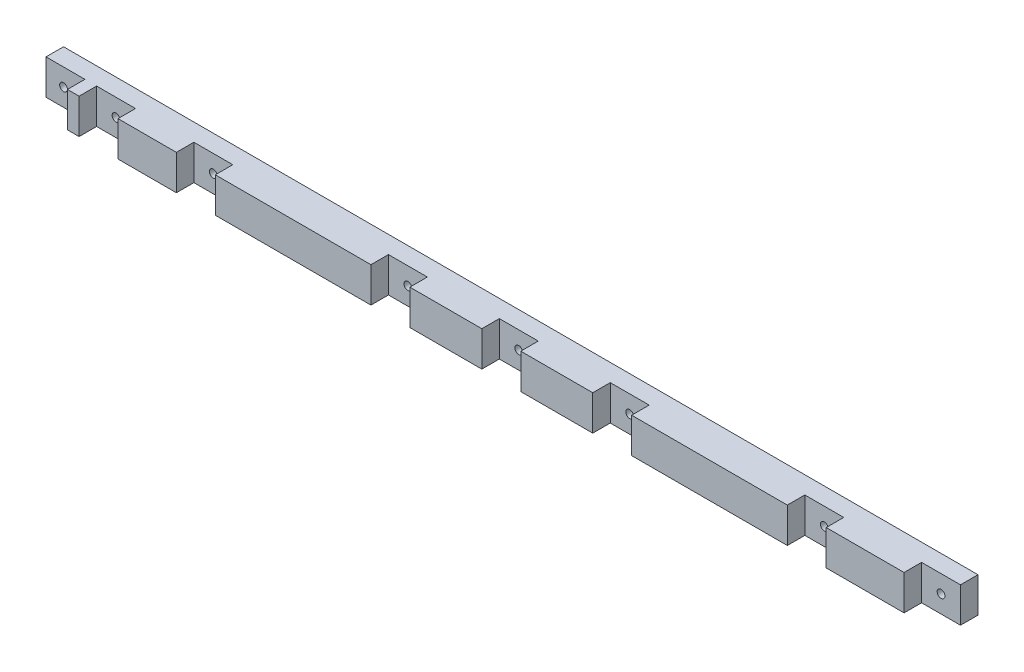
ISO-10303-21;
HEADER;
FILE_DESCRIPTION(('STEP AP214'),'2;1');
FILE_NAME('part.step','',(''),(''),'','','');
FILE_SCHEMA(('AUTOMOTIVE_DESIGN { 1 0 10303 214 1 1 1 1 }'));
ENDSEC;
DATA;
#1=APPLICATION_CONTEXT('core data for automotive mechanical design processes');
#2=APPLICATION_PROTOCOL_DEFINITION('international standard','automotive_design',2000,#1);
#3=PRODUCT_CONTEXT('',#1,'mechanical');
#4=PRODUCT('Part','Part','',(#3));
#5=PRODUCT_RELATED_PRODUCT_CATEGORY('part','',(#4));
#6=PRODUCT_DEFINITION_FORMATION('','',#4);
#7=PRODUCT_DEFINITION_CONTEXT('part definition',#1,'design');
#8=PRODUCT_DEFINITION('design','',#6,#7);
#9=PRODUCT_DEFINITION_SHAPE('','',#8);
#10=(LENGTH_UNIT() NAMED_UNIT(*) SI_UNIT(.MILLI.,.METRE.));
#11=(NAMED_UNIT(*) PLANE_ANGLE_UNIT() SI_UNIT($,.RADIAN.));
#12=(NAMED_UNIT(*) SI_UNIT($,.STERADIAN.) SOLID_ANGLE_UNIT());
#13=UNCERTAINTY_MEASURE_WITH_UNIT(LENGTH_MEASURE(1.E-05),#10,'distance_accuracy_value','');
#14=(GEOMETRIC_REPRESENTATION_CONTEXT(3) GLOBAL_UNCERTAINTY_ASSIGNED_CONTEXT((#13)) GLOBAL_UNIT_ASSIGNED_CONTEXT((#10,
#11,#12)) REPRESENTATION_CONTEXT('',''));
#15=CARTESIAN_POINT('',(0.,0.,0.));
#16=DIRECTION('',(0.,0.,1.));
#17=DIRECTION('',(1.,0.,0.));
#18=AXIS2_PLACEMENT_3D('',#15,#16,#17);
#19=CARTESIAN_POINT('',(0.,9.,9.));
#20=DIRECTION('',(0.,0.,-1.));
#21=DIRECTION('',(-1.,0.,0.));
#22=AXIS2_PLACEMENT_3D('',#19,#20,#21);
#23=PLANE('',#22);
#24=DIRECTION('',(1.,0.,0.));
#25=VECTOR('',#24,1.);
#26=CARTESIAN_POINT('',(0.,0.,9.));
#27=LINE('',#26,#25);
#28=CARTESIAN_POINT('',(155.,0.,9.));
#29=VERTEX_POINT('',#28);
#30=CARTESIAN_POINT('',(195.,0.,9.));
#31=VERTEX_POINT('',#30);
#32=EDGE_CURVE('E618',#29,#31,#27,.T.);
#33=ORIENTED_EDGE('',*,*,#32,.T.);
#34=DIRECTION('',(0.,-1.,0.));
#35=VECTOR('',#34,1.);
#36=CARTESIAN_POINT('',(195.,0.,9.));
#37=LINE('',#36,#35);
#38=CARTESIAN_POINT('',(195.,9.,9.));
#39=VERTEX_POINT('',#38);
#40=EDGE_CURVE('E488',#39,#31,#37,.T.);
#41=ORIENTED_EDGE('',*,*,#40,.F.);
#42=DIRECTION('',(-1.,0.,0.));
#43=VECTOR('',#42,1.);
#44=CARTESIAN_POINT('',(0.,9.,9.));
#45=LINE('',#44,#43);
#46=CARTESIAN_POINT('',(155.,9.,9.));
#47=VERTEX_POINT('',#46);
#48=EDGE_CURVE('E281',#39,#47,#45,.T.);
#49=ORIENTED_EDGE('',*,*,#48,.T.);
#50=DIRECTION('',(0.,1.,0.));
#51=VECTOR('',#50,1.);
#52=CARTESIAN_POINT('',(155.,0.,9.));
#53=LINE('',#52,#51);
#54=EDGE_CURVE('E453',#29,#47,#53,.T.);
#55=ORIENTED_EDGE('',*,*,#54,.F.);
#56=EDGE_LOOP('',(#33,#41,#49,#55));
#57=FACE_BOUND('',#56,.T.);
#58=ADVANCED_FACE('F31',(#57),#23,.F.);
#59=CARTESIAN_POINT('',(126.5,0.,9.));
#60=VERTEX_POINT('',#59);
#61=CARTESIAN_POINT('',(145.,0.,9.));
#62=VERTEX_POINT('',#61);
#63=EDGE_CURVE('E620',#60,#62,#27,.T.);
#64=ORIENTED_EDGE('',*,*,#63,.T.);
#65=DIRECTION('',(0.,-1.,0.));
#66=VECTOR('',#65,1.);
#67=CARTESIAN_POINT('',(145.,0.,9.));
#68=LINE('',#67,#66);
#69=CARTESIAN_POINT('',(145.,9.,9.));
#70=VERTEX_POINT('',#69);
#71=EDGE_CURVE('E457',#70,#62,#68,.T.);
#72=ORIENTED_EDGE('',*,*,#71,.F.);
#73=CARTESIAN_POINT('',(126.5,9.,9.));
#74=VERTEX_POINT('',#73);
#75=EDGE_CURVE('E597',#70,#74,#45,.T.);
#76=ORIENTED_EDGE('',*,*,#75,.T.);
#77=DIRECTION('',(0.,1.,0.));
#78=VECTOR('',#77,1.);
#79=CARTESIAN_POINT('',(126.5,0.,9.));
#80=LINE('',#79,#78);
#81=EDGE_CURVE('E420',#60,#74,#80,.T.);
#82=ORIENTED_EDGE('',*,*,#81,.F.);
#83=EDGE_LOOP('',(#64,#72,#76,#82));
#84=FACE_BOUND('',#83,.T.);
#85=ADVANCED_FACE('F538',(#84),#23,.F.);
#86=CARTESIAN_POINT('',(98.,0.,9.));
#87=VERTEX_POINT('',#86);
#88=CARTESIAN_POINT('',(116.5,0.,9.));
#89=VERTEX_POINT('',#88);
#90=EDGE_CURVE('E622',#87,#89,#27,.T.);
#91=ORIENTED_EDGE('',*,*,#90,.T.);
#92=DIRECTION('',(0.,-1.,0.));
#93=VECTOR('',#92,1.);
#94=CARTESIAN_POINT('',(116.5,0.,9.));
#95=LINE('',#94,#93);
#96=CARTESIAN_POINT('',(116.5,9.,9.));
#97=VERTEX_POINT('',#96);
#98=EDGE_CURVE('E424',#97,#89,#95,.T.);
#99=ORIENTED_EDGE('',*,*,#98,.F.);
#100=CARTESIAN_POINT('',(98.,9.,9.));
#101=VERTEX_POINT('',#100);
#102=EDGE_CURVE('E592',#97,#101,#45,.T.);
#103=ORIENTED_EDGE('',*,*,#102,.T.);
#104=DIRECTION('',(0.,1.,0.));
#105=VECTOR('',#104,1.);
#106=CARTESIAN_POINT('',(98.,0.,9.));
#107=LINE('',#106,#105);
#108=EDGE_CURVE('E387',#87,#101,#107,.T.);
#109=ORIENTED_EDGE('',*,*,#108,.F.);
#110=EDGE_LOOP('',(#91,#99,#103,#109));
#111=FACE_BOUND('',#110,.T.);
#112=ADVANCED_FACE('F545',(#111),#23,.F.);
#113=CARTESIAN_POINT('',(48.,0.,9.));
#114=VERTEX_POINT('',#113);
#115=CARTESIAN_POINT('',(88.,0.,9.));
#116=VERTEX_POINT('',#115);
#117=EDGE_CURVE('E765',#114,#116,#27,.T.);
#118=ORIENTED_EDGE('',*,*,#117,.T.);
#119=DIRECTION('',(0.,-1.,0.));
#120=VECTOR('',#119,1.);
#121=CARTESIAN_POINT('',(88.,0.,9.));
#122=LINE('',#121,#120);
#123=CARTESIAN_POINT('',(88.,9.,9.));
#124=VERTEX_POINT('',#123);
#125=EDGE_CURVE('E391',#124,#116,#122,.T.);
#126=ORIENTED_EDGE('',*,*,#125,.F.);
#127=CARTESIAN_POINT('',(48.,9.,9.));
#128=VERTEX_POINT('',#127);
#129=EDGE_CURVE('E588',#124,#128,#45,.T.);
#130=ORIENTED_EDGE('',*,*,#129,.T.);
#131=DIRECTION('',(0.,1.,0.));
#132=VECTOR('',#131,1.);
#133=CARTESIAN_POINT('',(48.,0.,9.));
#134=LINE('',#133,#132);
#135=EDGE_CURVE('E354',#114,#128,#134,.T.);
#136=ORIENTED_EDGE('',*,*,#135,.F.);
#137=EDGE_LOOP('',(#118,#126,#130,#136));
#138=FACE_BOUND('',#137,.T.);
#139=ADVANCED_FACE('F569',(#138),#23,.F.);
#140=CARTESIAN_POINT('',(23.,0.,9.));
#141=VERTEX_POINT('',#140);
#142=CARTESIAN_POINT('',(38.,0.,9.));
#143=VERTEX_POINT('',#142);
#144=EDGE_CURVE('E286',#141,#143,#27,.T.);
#145=ORIENTED_EDGE('',*,*,#144,.T.);
#146=DIRECTION('',(0.,-1.,0.));
#147=VECTOR('',#146,1.);
#148=CARTESIAN_POINT('',(38.,0.,9.));
#149=LINE('',#148,#147);
#150=CARTESIAN_POINT('',(38.,9.,9.));
#151=VERTEX_POINT('',#150);
#152=EDGE_CURVE('E358',#151,#143,#149,.T.);
#153=ORIENTED_EDGE('',*,*,#152,.F.);
#154=CARTESIAN_POINT('',(23.,9.,9.));
#155=VERTEX_POINT('',#154);
#156=EDGE_CURVE('E587',#151,#155,#45,.T.);
#157=ORIENTED_EDGE('',*,*,#156,.T.);
#158=DIRECTION('',(0.,1.,0.));
#159=VECTOR('',#158,1.);
#160=CARTESIAN_POINT('',(23.,0.,9.));
#161=LINE('',#160,#159);
#162=EDGE_CURVE('E321',#141,#155,#161,.T.);
#163=ORIENTED_EDGE('',*,*,#162,.F.);
#164=EDGE_LOOP('',(#145,#153,#157,#163));
#165=FACE_BOUND('',#164,.T.);
#166=ADVANCED_FACE('F561',(#165),#23,.F.);
#167=CARTESIAN_POINT('',(10.,0.,9.));
#168=VERTEX_POINT('',#167);
#169=CARTESIAN_POINT('',(13.,0.,9.));
#170=VERTEX_POINT('',#169);
#171=EDGE_CURVE('E283',#168,#170,#27,.T.);
#172=ORIENTED_EDGE('',*,*,#171,.T.);
#173=DIRECTION('',(0.,-1.,0.));
#174=VECTOR('',#173,1.);
#175=CARTESIAN_POINT('',(13.,0.,9.));
#176=LINE('',#175,#174);
#177=CARTESIAN_POINT('',(13.,9.,9.));
#178=VERTEX_POINT('',#177);
#179=EDGE_CURVE('E325',#178,#170,#176,.T.);
#180=ORIENTED_EDGE('',*,*,#179,.F.);
#181=CARTESIAN_POINT('',(10.,9.,9.));
#182=VERTEX_POINT('',#181);
#183=EDGE_CURVE('E282',#178,#182,#45,.T.);
#184=ORIENTED_EDGE('',*,*,#183,.T.);
#185=DIRECTION('',(0.,1.,0.));
#186=VECTOR('',#185,1.);
#187=CARTESIAN_POINT('',(10.,0.,9.));
#188=LINE('',#187,#186);
#189=EDGE_CURVE('E292',#168,#182,#188,.T.);
#190=ORIENTED_EDGE('',*,*,#189,.F.);
#191=EDGE_LOOP('',(#172,#180,#184,#190));
#192=FACE_BOUND('',#191,.T.);
#193=ADVANCED_FACE('F552',(#192),#23,.F.);
#194=CARTESIAN_POINT('',(0.,0.,9.));
#195=DIRECTION('',(1.,0.,0.));
#196=DIRECTION('',(0.,0.,-1.));
#197=AXIS2_PLACEMENT_3D('',#194,#195,#196);
#198=PLANE('',#197);
#199=DIRECTION('',(0.,0.,-1.));
#200=VECTOR('',#199,1.);
#201=CARTESIAN_POINT('',(0.,0.,9.));
#202=LINE('',#201,#200);
#203=CARTESIAN_POINT('',(0.,0.,4.5));
#204=VERTEX_POINT('',#203);
#205=CARTESIAN_POINT('',(0.,0.,0.));
#206=VERTEX_POINT('',#205);
#207=EDGE_CURVE('E11',#204,#206,#202,.T.);
#208=ORIENTED_EDGE('',*,*,#207,.F.);
#209=DIRECTION('',(0.,-1.,0.));
#210=VECTOR('',#209,1.);
#211=CARTESIAN_POINT('',(0.,0.,4.5));
#212=LINE('',#211,#210);
#213=CARTESIAN_POINT('',(0.,9.,4.5));
#214=VERTEX_POINT('',#213);
#215=EDGE_CURVE('E295',#214,#204,#212,.T.);
#216=ORIENTED_EDGE('',*,*,#215,.F.);
#217=DIRECTION('',(0.,0.,-1.));
#218=VECTOR('',#217,1.);
#219=CARTESIAN_POINT('',(0.,9.,9.));
#220=LINE('',#219,#218);
#221=CARTESIAN_POINT('',(0.,9.,0.));
#222=VERTEX_POINT('',#221);
#223=EDGE_CURVE('E264',#214,#222,#220,.T.);
#224=ORIENTED_EDGE('',*,*,#223,.T.);
#225=DIRECTION('',(0.,-1.,0.));
#226=VECTOR('',#225,1.);
#227=CARTESIAN_POINT('',(0.,0.,0.));
#228=LINE('',#227,#226);
#229=EDGE_CURVE('E276',#222,#206,#228,.T.);
#230=ORIENTED_EDGE('',*,*,#229,.T.);
#231=EDGE_LOOP('',(#208,#216,#224,#230));
#232=FACE_BOUND('',#231,.T.);
#233=ADVANCED_FACE('F33',(#232),#198,.F.);
#234=CARTESIAN_POINT('',(0.,0.,9.));
#235=DIRECTION('',(0.,1.,0.));
#236=DIRECTION('',(0.,0.,1.));
#237=AXIS2_PLACEMENT_3D('',#234,#235,#236);
#238=PLANE('',#237);
#239=DIRECTION('',(1.,0.,0.));
#240=VECTOR('',#239,1.);
#241=CARTESIAN_POINT('',(235.,0.,4.5));
#242=LINE('',#241,#240);
#243=CARTESIAN_POINT('',(225.,0.,4.5));
#244=VERTEX_POINT('',#243);
#245=CARTESIAN_POINT('',(235.,0.,4.5));
#246=VERTEX_POINT('',#245);
#247=EDGE_CURVE('E246',#244,#246,#242,.T.);
#248=ORIENTED_EDGE('',*,*,#247,.F.);
#249=DIRECTION('',(0.,0.,1.));
#250=VECTOR('',#249,1.);
#251=CARTESIAN_POINT('',(225.,0.,4.5));
#252=LINE('',#251,#250);
#253=CARTESIAN_POINT('',(225.,0.,9.));
#254=VERTEX_POINT('',#253);
#255=EDGE_CURVE('E504',#244,#254,#252,.T.);
#256=ORIENTED_EDGE('',*,*,#255,.T.);
#257=CARTESIAN_POINT('',(205.,0.,9.));
#258=VERTEX_POINT('',#257);
#259=EDGE_CURVE('E271',#258,#254,#27,.T.);
#260=ORIENTED_EDGE('',*,*,#259,.F.);
#261=DIRECTION('',(0.,0.,1.));
#262=VECTOR('',#261,1.);
#263=CARTESIAN_POINT('',(205.,0.,4.5));
#264=LINE('',#263,#262);
#265=CARTESIAN_POINT('',(205.,0.,4.5));
#266=VERTEX_POINT('',#265);
#267=EDGE_CURVE('E54',#266,#258,#264,.T.);
#268=ORIENTED_EDGE('',*,*,#267,.F.);
#269=DIRECTION('',(1.,0.,0.));
#270=VECTOR('',#269,1.);
#271=CARTESIAN_POINT('',(195.,0.,4.5));
#272=LINE('',#271,#270);
#273=CARTESIAN_POINT('',(195.,0.,4.5));
#274=VERTEX_POINT('',#273);
#275=EDGE_CURVE('E496',#274,#266,#272,.T.);
#276=ORIENTED_EDGE('',*,*,#275,.F.);
#277=DIRECTION('',(0.,0.,1.));
#278=VECTOR('',#277,1.);
#279=CARTESIAN_POINT('',(195.,0.,4.5));
#280=LINE('',#279,#278);
#281=EDGE_CURVE('E476',#274,#31,#280,.T.);
#282=ORIENTED_EDGE('',*,*,#281,.T.);
#283=ORIENTED_EDGE('',*,*,#32,.F.);
#284=DIRECTION('',(0.,0.,1.));
#285=VECTOR('',#284,1.);
#286=CARTESIAN_POINT('',(155.,0.,4.5));
#287=LINE('',#286,#285);
#288=CARTESIAN_POINT('',(155.,0.,4.5));
#289=VERTEX_POINT('',#288);
#290=EDGE_CURVE('E446',#289,#29,#287,.T.);
#291=ORIENTED_EDGE('',*,*,#290,.F.);
#292=DIRECTION('',(1.,0.,0.));
#293=VECTOR('',#292,1.);
#294=CARTESIAN_POINT('',(145.,0.,4.5));
#295=LINE('',#294,#293);
#296=CARTESIAN_POINT('',(145.,0.,4.5));
#297=VERTEX_POINT('',#296);
#298=EDGE_CURVE('E465',#297,#289,#295,.T.);
#299=ORIENTED_EDGE('',*,*,#298,.F.);
#300=DIRECTION('',(0.,0.,1.));
#301=VECTOR('',#300,1.);
#302=CARTESIAN_POINT('',(145.,0.,4.5));
#303=LINE('',#302,#301);
#304=EDGE_CURVE('E443',#297,#62,#303,.T.);
#305=ORIENTED_EDGE('',*,*,#304,.T.);
#306=ORIENTED_EDGE('',*,*,#63,.F.);
#307=DIRECTION('',(0.,0.,1.));
#308=VECTOR('',#307,1.);
#309=CARTESIAN_POINT('',(126.5,0.,4.5));
#310=LINE('',#309,#308);
#311=CARTESIAN_POINT('',(126.5,0.,4.5));
#312=VERTEX_POINT('',#311);
#313=EDGE_CURVE('E413',#312,#60,#310,.T.);
#314=ORIENTED_EDGE('',*,*,#313,.F.);
#315=DIRECTION('',(1.,0.,0.));
#316=VECTOR('',#315,1.);
#317=CARTESIAN_POINT('',(116.5,0.,4.5));
#318=LINE('',#317,#316);
#319=CARTESIAN_POINT('',(116.5,0.,4.5));
#320=VERTEX_POINT('',#319);
#321=EDGE_CURVE('E432',#320,#312,#318,.T.);
#322=ORIENTED_EDGE('',*,*,#321,.F.);
#323=DIRECTION('',(0.,0.,1.));
#324=VECTOR('',#323,1.);
#325=CARTESIAN_POINT('',(116.5,0.,4.5));
#326=LINE('',#325,#324);
#327=EDGE_CURVE('E410',#320,#89,#326,.T.);
#328=ORIENTED_EDGE('',*,*,#327,.T.);
#329=ORIENTED_EDGE('',*,*,#90,.F.);
#330=DIRECTION('',(0.,0.,1.));
#331=VECTOR('',#330,1.);
#332=CARTESIAN_POINT('',(98.,0.,4.5));
#333=LINE('',#332,#331);
#334=CARTESIAN_POINT('',(98.,0.,4.5));
#335=VERTEX_POINT('',#334);
#336=EDGE_CURVE('E380',#335,#87,#333,.T.);
#337=ORIENTED_EDGE('',*,*,#336,.F.);
#338=DIRECTION('',(1.,0.,0.));
#339=VECTOR('',#338,1.);
#340=CARTESIAN_POINT('',(88.,0.,4.5));
#341=LINE('',#340,#339);
#342=CARTESIAN_POINT('',(88.,0.,4.5));
#343=VERTEX_POINT('',#342);
#344=EDGE_CURVE('E399',#343,#335,#341,.T.);
#345=ORIENTED_EDGE('',*,*,#344,.F.);
#346=DIRECTION('',(0.,0.,1.));
#347=VECTOR('',#346,1.);
#348=CARTESIAN_POINT('',(88.,0.,4.5));
#349=LINE('',#348,#347);
#350=EDGE_CURVE('E377',#343,#116,#349,.T.);
#351=ORIENTED_EDGE('',*,*,#350,.T.);
#352=ORIENTED_EDGE('',*,*,#117,.F.);
#353=DIRECTION('',(0.,0.,1.));
#354=VECTOR('',#353,1.);
#355=CARTESIAN_POINT('',(48.,0.,4.5));
#356=LINE('',#355,#354);
#357=CARTESIAN_POINT('',(48.,0.,4.5));
#358=VERTEX_POINT('',#357);
#359=EDGE_CURVE('E347',#358,#114,#356,.T.);
#360=ORIENTED_EDGE('',*,*,#359,.F.);
#361=DIRECTION('',(1.,0.,0.));
#362=VECTOR('',#361,1.);
#363=CARTESIAN_POINT('',(38.,0.,4.5));
#364=LINE('',#363,#362);
#365=CARTESIAN_POINT('',(38.,0.,4.5));
#366=VERTEX_POINT('',#365);
#367=EDGE_CURVE('E366',#366,#358,#364,.T.);
#368=ORIENTED_EDGE('',*,*,#367,.F.);
#369=DIRECTION('',(0.,0.,1.));
#370=VECTOR('',#369,1.);
#371=CARTESIAN_POINT('',(38.,0.,4.5));
#372=LINE('',#371,#370);
#373=EDGE_CURVE('E344',#366,#143,#372,.T.);
#374=ORIENTED_EDGE('',*,*,#373,.T.);
#375=ORIENTED_EDGE('',*,*,#144,.F.);
#376=DIRECTION('',(0.,0.,1.));
#377=VECTOR('',#376,1.);
#378=CARTESIAN_POINT('',(23.,0.,4.5));
#379=LINE('',#378,#377);
#380=CARTESIAN_POINT('',(23.,0.,4.5));
#381=VERTEX_POINT('',#380);
#382=EDGE_CURVE('E314',#381,#141,#379,.T.);
#383=ORIENTED_EDGE('',*,*,#382,.F.);
#384=DIRECTION('',(1.,0.,0.));
#385=VECTOR('',#384,1.);
#386=CARTESIAN_POINT('',(13.,0.,4.5));
#387=LINE('',#386,#385);
#388=CARTESIAN_POINT('',(13.,0.,4.5));
#389=VERTEX_POINT('',#388);
#390=EDGE_CURVE('E333',#389,#381,#387,.T.);
#391=ORIENTED_EDGE('',*,*,#390,.F.);
#392=DIRECTION('',(0.,0.,1.));
#393=VECTOR('',#392,1.);
#394=CARTESIAN_POINT('',(13.,0.,4.5));
#395=LINE('',#394,#393);
#396=EDGE_CURVE('E311',#389,#170,#395,.T.);
#397=ORIENTED_EDGE('',*,*,#396,.T.);
#398=ORIENTED_EDGE('',*,*,#171,.F.);
#399=DIRECTION('',(0.,0.,1.));
#400=VECTOR('',#399,1.);
#401=CARTESIAN_POINT('',(10.,0.,4.5));
#402=LINE('',#401,#400);
#403=CARTESIAN_POINT('',(10.,0.,4.5));
#404=VERTEX_POINT('',#403);
#405=EDGE_CURVE('E287',#404,#168,#402,.T.);
#406=ORIENTED_EDGE('',*,*,#405,.F.);
#407=DIRECTION('',(1.,0.,0.));
#408=VECTOR('',#407,1.);
#409=CARTESIAN_POINT('',(0.,0.,4.5));
#410=LINE('',#409,#408);
#411=EDGE_CURVE('E301',#204,#404,#410,.T.);
#412=ORIENTED_EDGE('',*,*,#411,.F.);
#413=ORIENTED_EDGE('',*,*,#207,.T.);
#414=DIRECTION('',(1.,0.,0.));
#415=VECTOR('',#414,1.);
#416=CARTESIAN_POINT('',(0.,0.,0.));
#417=LINE('',#416,#415);
#418=CARTESIAN_POINT('',(235.,0.,0.));
#419=VERTEX_POINT('',#418);
#420=EDGE_CURVE('E273',#206,#419,#417,.T.);
#421=ORIENTED_EDGE('',*,*,#420,.T.);
#422=DIRECTION('',(0.,0.,-1.));
#423=VECTOR('',#422,1.);
#424=CARTESIAN_POINT('',(235.,0.,9.));
#425=LINE('',#424,#423);
#426=EDGE_CURVE('E39',#246,#419,#425,.T.);
#427=ORIENTED_EDGE('',*,*,#426,.F.);
#428=EDGE_LOOP('',(#248,#256,#260,#268,#276,#282,#283,#291,#299,#305,#306,#314,#322,#328,#329,
#337,#345,#351,#352,#360,#368,#374,#375,#383,#391,#397,#398,#406,#412,#413,#421,#427));
#429=FACE_BOUND('',#428,.T.);
#430=ADVANCED_FACE('F567',(#429),#238,.F.);
#431=CARTESIAN_POINT('',(235.,0.,9.));
#432=DIRECTION('',(-1.,0.,0.));
#433=DIRECTION('',(0.,0.,1.));
#434=AXIS2_PLACEMENT_3D('',#431,#432,#433);
#435=PLANE('',#434);
#436=DIRECTION('',(0.,0.,-1.));
#437=VECTOR('',#436,1.);
#438=CARTESIAN_POINT('',(235.,9.,9.));
#439=LINE('',#438,#437);
#440=CARTESIAN_POINT('',(235.,9.,4.5));
#441=VERTEX_POINT('',#440);
#442=CARTESIAN_POINT('',(235.,9.,0.));
#443=VERTEX_POINT('',#442);
#444=EDGE_CURVE('E256',#441,#443,#439,.T.);
#445=ORIENTED_EDGE('',*,*,#444,.F.);
#446=DIRECTION('',(0.,1.,0.));
#447=VECTOR('',#446,1.);
#448=CARTESIAN_POINT('',(235.,9.,4.5));
#449=LINE('',#448,#447);
#450=EDGE_CURVE('E240',#246,#441,#449,.T.);
#451=ORIENTED_EDGE('',*,*,#450,.F.);
#452=ORIENTED_EDGE('',*,*,#426,.T.);
#453=DIRECTION('',(0.,1.,0.));
#454=VECTOR('',#453,1.);
#455=CARTESIAN_POINT('',(235.,0.,0.));
#456=LINE('',#455,#454);
#457=EDGE_CURVE('E262',#419,#443,#456,.T.);
#458=ORIENTED_EDGE('',*,*,#457,.T.);
#459=EDGE_LOOP('',(#445,#451,#452,#458));
#460=FACE_BOUND('',#459,.T.);
#461=ADVANCED_FACE('F260',(#460),#435,.F.);
#462=CARTESIAN_POINT('',(0.,9.,9.));
#463=DIRECTION('',(0.,-1.,0.));
#464=DIRECTION('',(0.,0.,-1.));
#465=AXIS2_PLACEMENT_3D('',#462,#463,#464);
#466=PLANE('',#465);
#467=CARTESIAN_POINT('',(225.,9.,9.));
#468=VERTEX_POINT('',#467);
#469=CARTESIAN_POINT('',(205.,9.,9.));
#470=VERTEX_POINT('',#469);
#471=EDGE_CURVE('E266',#468,#470,#45,.T.);
#472=ORIENTED_EDGE('',*,*,#471,.F.);
#473=DIRECTION('',(0.,0.,1.));
#474=VECTOR('',#473,1.);
#475=CARTESIAN_POINT('',(225.,9.,4.5));
#476=LINE('',#475,#474);
#477=CARTESIAN_POINT('',(225.,9.,4.5));
#478=VERTEX_POINT('',#477);
#479=EDGE_CURVE('E46',#478,#468,#476,.T.);
#480=ORIENTED_EDGE('',*,*,#479,.F.);
#481=DIRECTION('',(-1.,0.,0.));
#482=VECTOR('',#481,1.);
#483=CARTESIAN_POINT('',(235.,9.,4.5));
#484=LINE('',#483,#482);
#485=EDGE_CURVE('E244',#441,#478,#484,.T.);
#486=ORIENTED_EDGE('',*,*,#485,.F.);
#487=ORIENTED_EDGE('',*,*,#444,.T.);
#488=DIRECTION('',(-1.,0.,0.));
#489=VECTOR('',#488,1.);
#490=CARTESIAN_POINT('',(0.,9.,0.));
#491=LINE('',#490,#489);
#492=EDGE_CURVE('E269',#443,#222,#491,.T.);
#493=ORIENTED_EDGE('',*,*,#492,.T.);
#494=ORIENTED_EDGE('',*,*,#223,.F.);
#495=DIRECTION('',(-1.,0.,0.));
#496=VECTOR('',#495,1.);
#497=CARTESIAN_POINT('',(0.,9.,4.5));
#498=LINE('',#497,#496);
#499=CARTESIAN_POINT('',(10.,9.,4.5));
#500=VERTEX_POINT('',#499);
#501=EDGE_CURVE('E289',#500,#214,#498,.T.);
#502=ORIENTED_EDGE('',*,*,#501,.F.);
#503=DIRECTION('',(0.,0.,1.));
#504=VECTOR('',#503,1.);
#505=CARTESIAN_POINT('',(10.,9.,4.5));
#506=LINE('',#505,#504);
#507=EDGE_CURVE('E279',#500,#182,#506,.T.);
#508=ORIENTED_EDGE('',*,*,#507,.T.);
#509=ORIENTED_EDGE('',*,*,#183,.F.);
#510=DIRECTION('',(0.,0.,1.));
#511=VECTOR('',#510,1.);
#512=CARTESIAN_POINT('',(13.,9.,4.5));
#513=LINE('',#512,#511);
#514=CARTESIAN_POINT('',(13.,9.,4.5));
#515=VERTEX_POINT('',#514);
#516=EDGE_CURVE('E308',#515,#178,#513,.T.);
#517=ORIENTED_EDGE('',*,*,#516,.F.);
#518=DIRECTION('',(-1.,0.,0.));
#519=VECTOR('',#518,1.);
#520=CARTESIAN_POINT('',(13.,9.,4.5));
#521=LINE('',#520,#519);
#522=CARTESIAN_POINT('',(23.,9.,4.5));
#523=VERTEX_POINT('',#522);
#524=EDGE_CURVE('E315',#523,#515,#521,.T.);
#525=ORIENTED_EDGE('',*,*,#524,.F.);
#526=DIRECTION('',(0.,0.,1.));
#527=VECTOR('',#526,1.);
#528=CARTESIAN_POINT('',(23.,9.,4.5));
#529=LINE('',#528,#527);
#530=EDGE_CURVE('E317',#523,#155,#529,.T.);
#531=ORIENTED_EDGE('',*,*,#530,.T.);
#532=ORIENTED_EDGE('',*,*,#156,.F.);
#533=DIRECTION('',(0.,0.,1.));
#534=VECTOR('',#533,1.);
#535=CARTESIAN_POINT('',(38.,9.,4.5));
#536=LINE('',#535,#534);
#537=CARTESIAN_POINT('',(38.,9.,4.5));
#538=VERTEX_POINT('',#537);
#539=EDGE_CURVE('E341',#538,#151,#536,.T.);
#540=ORIENTED_EDGE('',*,*,#539,.F.);
#541=DIRECTION('',(-1.,0.,0.));
#542=VECTOR('',#541,1.);
#543=CARTESIAN_POINT('',(38.,9.,4.5));
#544=LINE('',#543,#542);
#545=CARTESIAN_POINT('',(48.,9.,4.5));
#546=VERTEX_POINT('',#545);
#547=EDGE_CURVE('E348',#546,#538,#544,.T.);
#548=ORIENTED_EDGE('',*,*,#547,.F.);
#549=DIRECTION('',(0.,0.,1.));
#550=VECTOR('',#549,1.);
#551=CARTESIAN_POINT('',(48.,9.,4.5));
#552=LINE('',#551,#550);
#553=EDGE_CURVE('E350',#546,#128,#552,.T.);
#554=ORIENTED_EDGE('',*,*,#553,.T.);
#555=ORIENTED_EDGE('',*,*,#129,.F.);
#556=DIRECTION('',(0.,0.,1.));
#557=VECTOR('',#556,1.);
#558=CARTESIAN_POINT('',(88.,9.,4.5));
#559=LINE('',#558,#557);
#560=CARTESIAN_POINT('',(88.,9.,4.5));
#561=VERTEX_POINT('',#560);
#562=EDGE_CURVE('E374',#561,#124,#559,.T.);
#563=ORIENTED_EDGE('',*,*,#562,.F.);
#564=DIRECTION('',(-1.,0.,0.));
#565=VECTOR('',#564,1.);
#566=CARTESIAN_POINT('',(88.,9.,4.5));
#567=LINE('',#566,#565);
#568=CARTESIAN_POINT('',(98.,9.,4.5));
#569=VERTEX_POINT('',#568);
#570=EDGE_CURVE('E381',#569,#561,#567,.T.);
#571=ORIENTED_EDGE('',*,*,#570,.F.);
#572=DIRECTION('',(0.,0.,1.));
#573=VECTOR('',#572,1.);
#574=CARTESIAN_POINT('',(98.,9.,4.5));
#575=LINE('',#574,#573);
#576=EDGE_CURVE('E383',#569,#101,#575,.T.);
#577=ORIENTED_EDGE('',*,*,#576,.T.);
#578=ORIENTED_EDGE('',*,*,#102,.F.);
#579=DIRECTION('',(0.,0.,1.));
#580=VECTOR('',#579,1.);
#581=CARTESIAN_POINT('',(116.5,9.,4.5));
#582=LINE('',#581,#580);
#583=CARTESIAN_POINT('',(116.5,9.,4.5));
#584=VERTEX_POINT('',#583);
#585=EDGE_CURVE('E407',#584,#97,#582,.T.);
#586=ORIENTED_EDGE('',*,*,#585,.F.);
#587=DIRECTION('',(-1.,0.,0.));
#588=VECTOR('',#587,1.);
#589=CARTESIAN_POINT('',(116.5,9.,4.5));
#590=LINE('',#589,#588);
#591=CARTESIAN_POINT('',(126.5,9.,4.5));
#592=VERTEX_POINT('',#591);
#593=EDGE_CURVE('E414',#592,#584,#590,.T.);
#594=ORIENTED_EDGE('',*,*,#593,.F.);
#595=DIRECTION('',(0.,0.,1.));
#596=VECTOR('',#595,1.);
#597=CARTESIAN_POINT('',(126.5,9.,4.5));
#598=LINE('',#597,#596);
#599=EDGE_CURVE('E416',#592,#74,#598,.T.);
#600=ORIENTED_EDGE('',*,*,#599,.T.);
#601=ORIENTED_EDGE('',*,*,#75,.F.);
#602=DIRECTION('',(0.,0.,1.));
#603=VECTOR('',#602,1.);
#604=CARTESIAN_POINT('',(145.,9.,4.5));
#605=LINE('',#604,#603);
#606=CARTESIAN_POINT('',(145.,9.,4.5));
#607=VERTEX_POINT('',#606);
#608=EDGE_CURVE('E440',#607,#70,#605,.T.);
#609=ORIENTED_EDGE('',*,*,#608,.F.);
#610=DIRECTION('',(-1.,0.,0.));
#611=VECTOR('',#610,1.);
#612=CARTESIAN_POINT('',(145.,9.,4.5));
#613=LINE('',#612,#611);
#614=CARTESIAN_POINT('',(155.,9.,4.5));
#615=VERTEX_POINT('',#614);
#616=EDGE_CURVE('E447',#615,#607,#613,.T.);
#617=ORIENTED_EDGE('',*,*,#616,.F.);
#618=DIRECTION('',(0.,0.,1.));
#619=VECTOR('',#618,1.);
#620=CARTESIAN_POINT('',(155.,9.,4.5));
#621=LINE('',#620,#619);
#622=EDGE_CURVE('E449',#615,#47,#621,.T.);
#623=ORIENTED_EDGE('',*,*,#622,.T.);
#624=ORIENTED_EDGE('',*,*,#48,.F.);
#625=DIRECTION('',(0.,0.,1.));
#626=VECTOR('',#625,1.);
#627=CARTESIAN_POINT('',(195.,9.,4.5));
#628=LINE('',#627,#626);
#629=CARTESIAN_POINT('',(195.,9.,4.5));
#630=VERTEX_POINT('',#629);
#631=EDGE_CURVE('E473',#630,#39,#628,.T.);
#632=ORIENTED_EDGE('',*,*,#631,.F.);
#633=DIRECTION('',(-1.,0.,0.));
#634=VECTOR('',#633,1.);
#635=CARTESIAN_POINT('',(195.,9.,4.5));
#636=LINE('',#635,#634);
#637=CARTESIAN_POINT('',(205.,9.,4.5));
#638=VERTEX_POINT('',#637);
#639=EDGE_CURVE('E479',#638,#630,#636,.T.);
#640=ORIENTED_EDGE('',*,*,#639,.F.);
#641=DIRECTION('',(0.,0.,1.));
#642=VECTOR('',#641,1.);
#643=CARTESIAN_POINT('',(205.,9.,4.5));
#644=LINE('',#643,#642);
#645=EDGE_CURVE('E481',#638,#470,#644,.T.);
#646=ORIENTED_EDGE('',*,*,#645,.T.);
#647=EDGE_LOOP('',(#472,#480,#486,#487,#493,#494,#502,#508,#509,#517,#525,#531,#532,#540,#548,
#554,#555,#563,#571,#577,#578,#586,#594,#600,#601,#609,#617,#623,#624,#632,#640,#646));
#648=FACE_BOUND('',#647,.T.);
#649=ADVANCED_FACE('F254',(#648),#466,.F.);
#650=ORIENTED_EDGE('',*,*,#259,.T.);
#651=DIRECTION('',(0.,-1.,0.));
#652=VECTOR('',#651,1.);
#653=CARTESIAN_POINT('',(225.,9.,9.));
#654=LINE('',#653,#652);
#655=EDGE_CURVE('E250',#468,#254,#654,.T.);
#656=ORIENTED_EDGE('',*,*,#655,.F.);
#657=ORIENTED_EDGE('',*,*,#471,.T.);
#658=DIRECTION('',(0.,1.,0.));
#659=VECTOR('',#658,1.);
#660=CARTESIAN_POINT('',(205.,0.,9.));
#661=LINE('',#660,#659);
#662=EDGE_CURVE('E485',#258,#470,#661,.T.);
#663=ORIENTED_EDGE('',*,*,#662,.F.);
#664=EDGE_LOOP('',(#650,#656,#657,#663));
#665=FACE_BOUND('',#664,.T.);
#666=ADVANCED_FACE('F541',(#665),#23,.F.);
#667=CARTESIAN_POINT('',(0.,9.,0.));
#668=DIRECTION('',(0.,0.,-1.));
#669=DIRECTION('',(-1.,0.,0.));
#670=AXIS2_PLACEMENT_3D('',#667,#668,#669);
#671=PLANE('',#670);
#672=CARTESIAN_POINT('',(230.,4.5,0.));
#673=DIRECTION('',(0.,0.,1.));
#674=DIRECTION('',(1.,0.,0.));
#675=AXIS2_PLACEMENT_3D('',#672,#673,#674);
#676=CIRCLE('',#675,0.999999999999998);
#677=CARTESIAN_POINT('',(231.,4.5,0.));
#678=VERTEX_POINT('',#677);
#679=EDGE_CURVE('E511',#678,#678,#676,.T.);
#680=ORIENTED_EDGE('',*,*,#679,.T.);
#681=EDGE_LOOP('',(#680));
#682=FACE_BOUND('',#681,.T.);
#683=CARTESIAN_POINT('',(200.,4.5,0.));
#684=DIRECTION('',(0.,0.,1.));
#685=DIRECTION('',(1.,0.,0.));
#686=AXIS2_PLACEMENT_3D('',#683,#684,#685);
#687=CIRCLE('',#686,0.999999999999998);
#688=CARTESIAN_POINT('',(201.,4.5,0.));
#689=VERTEX_POINT('',#688);
#690=EDGE_CURVE('E490',#689,#689,#687,.T.);
#691=ORIENTED_EDGE('',*,*,#690,.T.);
#692=EDGE_LOOP('',(#691));
#693=FACE_BOUND('',#692,.T.);
#694=CARTESIAN_POINT('',(150.,4.5,0.));
#695=DIRECTION('',(0.,0.,1.));
#696=DIRECTION('',(1.,0.,0.));
#697=AXIS2_PLACEMENT_3D('',#694,#695,#696);
#698=CIRCLE('',#697,0.999999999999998);
#699=CARTESIAN_POINT('',(151.,4.5,0.));
#700=VERTEX_POINT('',#699);
#701=EDGE_CURVE('E459',#700,#700,#698,.T.);
#702=ORIENTED_EDGE('',*,*,#701,.T.);
#703=EDGE_LOOP('',(#702));
#704=FACE_BOUND('',#703,.T.);
#705=CARTESIAN_POINT('',(121.5,4.5,0.));
#706=DIRECTION('',(0.,0.,1.));
#707=DIRECTION('',(1.,0.,0.));
#708=AXIS2_PLACEMENT_3D('',#705,#706,#707);
#709=CIRCLE('',#708,0.999999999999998);
#710=CARTESIAN_POINT('',(122.5,4.5,0.));
#711=VERTEX_POINT('',#710);
#712=EDGE_CURVE('E426',#711,#711,#709,.T.);
#713=ORIENTED_EDGE('',*,*,#712,.T.);
#714=EDGE_LOOP('',(#713));
#715=FACE_BOUND('',#714,.T.);
#716=CARTESIAN_POINT('',(93.,4.5,0.));
#717=DIRECTION('',(0.,0.,1.));
#718=DIRECTION('',(1.,0.,0.));
#719=AXIS2_PLACEMENT_3D('',#716,#717,#718);
#720=CIRCLE('',#719,0.999999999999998);
#721=CARTESIAN_POINT('',(94.,4.5,0.));
#722=VERTEX_POINT('',#721);
#723=EDGE_CURVE('E393',#722,#722,#720,.T.);
#724=ORIENTED_EDGE('',*,*,#723,.T.);
#725=EDGE_LOOP('',(#724));
#726=FACE_BOUND('',#725,.T.);
#727=CARTESIAN_POINT('',(43.,4.5,0.));
#728=DIRECTION('',(0.,0.,1.));
#729=DIRECTION('',(1.,0.,0.));
#730=AXIS2_PLACEMENT_3D('',#727,#728,#729);
#731=CIRCLE('',#730,0.999999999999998);
#732=CARTESIAN_POINT('',(44.,4.5,0.));
#733=VERTEX_POINT('',#732);
#734=EDGE_CURVE('E360',#733,#733,#731,.T.);
#735=ORIENTED_EDGE('',*,*,#734,.T.);
#736=EDGE_LOOP('',(#735));
#737=FACE_BOUND('',#736,.T.);
#738=CARTESIAN_POINT('',(18.,4.5,0.));
#739=DIRECTION('',(0.,0.,1.));
#740=DIRECTION('',(1.,0.,0.));
#741=AXIS2_PLACEMENT_3D('',#738,#739,#740);
#742=CIRCLE('',#741,1.);
#743=CARTESIAN_POINT('',(19.,4.5,0.));
#744=VERTEX_POINT('',#743);
#745=EDGE_CURVE('E327',#744,#744,#742,.T.);
#746=ORIENTED_EDGE('',*,*,#745,.T.);
#747=EDGE_LOOP('',(#746));
#748=FACE_BOUND('',#747,.T.);
#749=CARTESIAN_POINT('',(4.5,4.5,0.));
#750=DIRECTION('',(0.,0.,1.));
#751=DIRECTION('',(1.,0.,0.));
#752=AXIS2_PLACEMENT_3D('',#749,#750,#751);
#753=CIRCLE('',#752,1.);
#754=CARTESIAN_POINT('',(5.5,4.5,0.));
#755=VERTEX_POINT('',#754);
#756=EDGE_CURVE('E296',#755,#755,#753,.T.);
#757=ORIENTED_EDGE('',*,*,#756,.T.);
#758=EDGE_LOOP('',(#757));
#759=FACE_BOUND('',#758,.T.);
#760=ORIENTED_EDGE('',*,*,#229,.F.);
#761=ORIENTED_EDGE('',*,*,#492,.F.);
#762=ORIENTED_EDGE('',*,*,#457,.F.);
#763=ORIENTED_EDGE('',*,*,#420,.F.);
#764=EDGE_LOOP('',(#760,#761,#762,#763));
#765=FACE_BOUND('',#764,.T.);
#766=ADVANCED_FACE('F520',(#682,#693,#704,#715,#726,#737,#748,#759,#765),#671,.T.);
#767=CARTESIAN_POINT('',(10.,0.,4.5));
#768=DIRECTION('',(1.,0.,0.));
#769=DIRECTION('',(0.,0.,-1.));
#770=AXIS2_PLACEMENT_3D('',#767,#768,#769);
#771=PLANE('',#770);
#772=ORIENTED_EDGE('',*,*,#189,.T.);
#773=ORIENTED_EDGE('',*,*,#507,.F.);
#774=DIRECTION('',(0.,1.,0.));
#775=VECTOR('',#774,1.);
#776=CARTESIAN_POINT('',(10.,0.,4.5));
#777=LINE('',#776,#775);
#778=EDGE_CURVE('E298',#404,#500,#777,.T.);
#779=ORIENTED_EDGE('',*,*,#778,.F.);
#780=ORIENTED_EDGE('',*,*,#405,.T.);
#781=EDGE_LOOP('',(#772,#773,#779,#780));
#782=FACE_BOUND('',#781,.T.);
#783=ADVANCED_FACE('F557',(#782),#771,.F.);
#784=CARTESIAN_POINT('',(0.,9.,4.5));
#785=DIRECTION('',(0.,0.,-1.));
#786=DIRECTION('',(-1.,0.,0.));
#787=AXIS2_PLACEMENT_3D('',#784,#785,#786);
#788=PLANE('',#787);
#789=CARTESIAN_POINT('',(4.5,4.5,4.5));
#790=DIRECTION('',(0.,0.,1.));
#791=DIRECTION('',(1.,0.,0.));
#792=AXIS2_PLACEMENT_3D('',#789,#790,#791);
#793=CIRCLE('',#792,1.);
#794=CARTESIAN_POINT('',(5.5,4.5,4.5));
#795=VERTEX_POINT('',#794);
#796=EDGE_CURVE('E305',#795,#795,#793,.T.);
#797=ORIENTED_EDGE('',*,*,#796,.F.);
#798=EDGE_LOOP('',(#797));
#799=FACE_BOUND('',#798,.T.);
#800=ORIENTED_EDGE('',*,*,#215,.T.);
#801=ORIENTED_EDGE('',*,*,#411,.T.);
#802=ORIENTED_EDGE('',*,*,#778,.T.);
#803=ORIENTED_EDGE('',*,*,#501,.T.);
#804=EDGE_LOOP('',(#800,#801,#802,#803));
#805=FACE_BOUND('',#804,.T.);
#806=ADVANCED_FACE('F631',(#799,#805),#788,.F.);
#807=CARTESIAN_POINT('',(4.5,4.5,0.));
#808=DIRECTION('',(0.,0.,1.));
#809=DIRECTION('',(1.,0.,0.));
#810=AXIS2_PLACEMENT_3D('',#807,#808,#809);
#811=CYLINDRICAL_SURFACE('',#810,1.);
#812=ORIENTED_EDGE('',*,*,#756,.F.);
#813=EDGE_LOOP('',(#812));
#814=FACE_BOUND('',#813,.T.);
#815=ORIENTED_EDGE('',*,*,#796,.T.);
#816=EDGE_LOOP('',(#815));
#817=FACE_BOUND('',#816,.T.);
#818=ADVANCED_FACE('F637',(#814,#817),#811,.F.);
#819=CARTESIAN_POINT('',(13.,0.,4.5));
#820=DIRECTION('',(-1.,0.,0.));
#821=DIRECTION('',(0.,0.,1.));
#822=AXIS2_PLACEMENT_3D('',#819,#820,#821);
#823=PLANE('',#822);
#824=ORIENTED_EDGE('',*,*,#179,.T.);
#825=ORIENTED_EDGE('',*,*,#396,.F.);
#826=DIRECTION('',(0.,-1.,0.));
#827=VECTOR('',#826,1.);
#828=CARTESIAN_POINT('',(13.,0.,4.5));
#829=LINE('',#828,#827);
#830=EDGE_CURVE('E324',#515,#389,#829,.T.);
#831=ORIENTED_EDGE('',*,*,#830,.F.);
#832=ORIENTED_EDGE('',*,*,#516,.T.);
#833=EDGE_LOOP('',(#824,#825,#831,#832));
#834=FACE_BOUND('',#833,.T.);
#835=ADVANCED_FACE('F581',(#834),#823,.F.);
#836=CARTESIAN_POINT('',(23.,0.,4.5));
#837=DIRECTION('',(1.,0.,0.));
#838=DIRECTION('',(0.,0.,-1.));
#839=AXIS2_PLACEMENT_3D('',#836,#837,#838);
#840=PLANE('',#839);
#841=ORIENTED_EDGE('',*,*,#162,.T.);
#842=ORIENTED_EDGE('',*,*,#530,.F.);
#843=DIRECTION('',(0.,1.,0.));
#844=VECTOR('',#843,1.);
#845=CARTESIAN_POINT('',(23.,0.,4.5));
#846=LINE('',#845,#844);
#847=EDGE_CURVE('E330',#381,#523,#846,.T.);
#848=ORIENTED_EDGE('',*,*,#847,.F.);
#849=ORIENTED_EDGE('',*,*,#382,.T.);
#850=EDGE_LOOP('',(#841,#842,#848,#849));
#851=FACE_BOUND('',#850,.T.);
#852=ADVANCED_FACE('F646',(#851),#840,.F.);
#853=CARTESIAN_POINT('',(13.,9.,4.5));
#854=DIRECTION('',(0.,0.,-1.));
#855=DIRECTION('',(-1.,0.,0.));
#856=AXIS2_PLACEMENT_3D('',#853,#854,#855);
#857=PLANE('',#856);
#858=CARTESIAN_POINT('',(18.,4.5,4.5));
#859=DIRECTION('',(0.,0.,1.));
#860=DIRECTION('',(1.,0.,0.));
#861=AXIS2_PLACEMENT_3D('',#858,#859,#860);
#862=CIRCLE('',#861,1.);
#863=CARTESIAN_POINT('',(19.,4.5,4.5));
#864=VERTEX_POINT('',#863);
#865=EDGE_CURVE('E338',#864,#864,#862,.T.);
#866=ORIENTED_EDGE('',*,*,#865,.F.);
#867=EDGE_LOOP('',(#866));
#868=FACE_BOUND('',#867,.T.);
#869=ORIENTED_EDGE('',*,*,#830,.T.);
#870=ORIENTED_EDGE('',*,*,#390,.T.);
#871=ORIENTED_EDGE('',*,*,#847,.T.);
#872=ORIENTED_EDGE('',*,*,#524,.T.);
#873=EDGE_LOOP('',(#869,#870,#871,#872));
#874=FACE_BOUND('',#873,.T.);
#875=ADVANCED_FACE('F583',(#868,#874),#857,.F.);
#876=CARTESIAN_POINT('',(18.,4.5,0.));
#877=DIRECTION('',(0.,0.,1.));
#878=DIRECTION('',(1.,0.,0.));
#879=AXIS2_PLACEMENT_3D('',#876,#877,#878);
#880=CYLINDRICAL_SURFACE('',#879,1.);
#881=ORIENTED_EDGE('',*,*,#745,.F.);
#882=EDGE_LOOP('',(#881));
#883=FACE_BOUND('',#882,.T.);
#884=ORIENTED_EDGE('',*,*,#865,.T.);
#885=EDGE_LOOP('',(#884));
#886=FACE_BOUND('',#885,.T.);
#887=ADVANCED_FACE('F652',(#883,#886),#880,.F.);
#888=CARTESIAN_POINT('',(38.,0.,4.5));
#889=DIRECTION('',(-1.,0.,0.));
#890=DIRECTION('',(0.,0.,1.));
#891=AXIS2_PLACEMENT_3D('',#888,#889,#890);
#892=PLANE('',#891);
#893=ORIENTED_EDGE('',*,*,#152,.T.);
#894=ORIENTED_EDGE('',*,*,#373,.F.);
#895=DIRECTION('',(0.,-1.,0.));
#896=VECTOR('',#895,1.);
#897=CARTESIAN_POINT('',(38.,0.,4.5));
#898=LINE('',#897,#896);
#899=EDGE_CURVE('E357',#538,#366,#898,.T.);
#900=ORIENTED_EDGE('',*,*,#899,.F.);
#901=ORIENTED_EDGE('',*,*,#539,.T.);
#902=EDGE_LOOP('',(#893,#894,#900,#901));
#903=FACE_BOUND('',#902,.T.);
#904=ADVANCED_FACE('F656',(#903),#892,.F.);
#905=CARTESIAN_POINT('',(48.,0.,4.5));
#906=DIRECTION('',(1.,0.,0.));
#907=DIRECTION('',(0.,0.,-1.));
#908=AXIS2_PLACEMENT_3D('',#905,#906,#907);
#909=PLANE('',#908);
#910=ORIENTED_EDGE('',*,*,#135,.T.);
#911=ORIENTED_EDGE('',*,*,#553,.F.);
#912=DIRECTION('',(0.,1.,0.));
#913=VECTOR('',#912,1.);
#914=CARTESIAN_POINT('',(48.,0.,4.5));
#915=LINE('',#914,#913);
#916=EDGE_CURVE('E363',#358,#546,#915,.T.);
#917=ORIENTED_EDGE('',*,*,#916,.F.);
#918=ORIENTED_EDGE('',*,*,#359,.T.);
#919=EDGE_LOOP('',(#910,#911,#917,#918));
#920=FACE_BOUND('',#919,.T.);
#921=ADVANCED_FACE('F660',(#920),#909,.F.);
#922=CARTESIAN_POINT('',(38.,9.,4.5));
#923=DIRECTION('',(0.,0.,-1.));
#924=DIRECTION('',(-1.,0.,0.));
#925=AXIS2_PLACEMENT_3D('',#922,#923,#924);
#926=PLANE('',#925);
#927=CARTESIAN_POINT('',(43.,4.5,4.5));
#928=DIRECTION('',(0.,0.,1.));
#929=DIRECTION('',(1.,0.,0.));
#930=AXIS2_PLACEMENT_3D('',#927,#928,#929);
#931=CIRCLE('',#930,0.999999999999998);
#932=CARTESIAN_POINT('',(44.,4.5,4.5));
#933=VERTEX_POINT('',#932);
#934=EDGE_CURVE('E371',#933,#933,#931,.T.);
#935=ORIENTED_EDGE('',*,*,#934,.F.);
#936=EDGE_LOOP('',(#935));
#937=FACE_BOUND('',#936,.T.);
#938=ORIENTED_EDGE('',*,*,#899,.T.);
#939=ORIENTED_EDGE('',*,*,#367,.T.);
#940=ORIENTED_EDGE('',*,*,#916,.T.);
#941=ORIENTED_EDGE('',*,*,#547,.T.);
#942=EDGE_LOOP('',(#938,#939,#940,#941));
#943=FACE_BOUND('',#942,.T.);
#944=ADVANCED_FACE('F664',(#937,#943),#926,.F.);
#945=CARTESIAN_POINT('',(43.,4.5,0.));
#946=DIRECTION('',(0.,0.,1.));
#947=DIRECTION('',(1.,0.,0.));
#948=AXIS2_PLACEMENT_3D('',#945,#946,#947);
#949=CYLINDRICAL_SURFACE('',#948,0.999999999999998);
#950=ORIENTED_EDGE('',*,*,#734,.F.);
#951=EDGE_LOOP('',(#950));
#952=FACE_BOUND('',#951,.T.);
#953=ORIENTED_EDGE('',*,*,#934,.T.);
#954=EDGE_LOOP('',(#953));
#955=FACE_BOUND('',#954,.T.);
#956=ADVANCED_FACE('F668',(#952,#955),#949,.F.);
#957=CARTESIAN_POINT('',(88.,0.,4.5));
#958=DIRECTION('',(-1.,0.,0.));
#959=DIRECTION('',(0.,0.,1.));
#960=AXIS2_PLACEMENT_3D('',#957,#958,#959);
#961=PLANE('',#960);
#962=ORIENTED_EDGE('',*,*,#125,.T.);
#963=ORIENTED_EDGE('',*,*,#350,.F.);
#964=DIRECTION('',(0.,-1.,0.));
#965=VECTOR('',#964,1.);
#966=CARTESIAN_POINT('',(88.,0.,4.5));
#967=LINE('',#966,#965);
#968=EDGE_CURVE('E390',#561,#343,#967,.T.);
#969=ORIENTED_EDGE('',*,*,#968,.F.);
#970=ORIENTED_EDGE('',*,*,#562,.T.);
#971=EDGE_LOOP('',(#962,#963,#969,#970));
#972=FACE_BOUND('',#971,.T.);
#973=ADVANCED_FACE('F672',(#972),#961,.F.);
#974=CARTESIAN_POINT('',(98.,0.,4.5));
#975=DIRECTION('',(1.,0.,0.));
#976=DIRECTION('',(0.,1.,0.));
#977=AXIS2_PLACEMENT_3D('',#974,#975,#976);
#978=PLANE('',#977);
#979=ORIENTED_EDGE('',*,*,#108,.T.);
#980=ORIENTED_EDGE('',*,*,#576,.F.);
#981=DIRECTION('',(0.,1.,0.));
#982=VECTOR('',#981,1.);
#983=CARTESIAN_POINT('',(98.,0.,4.5));
#984=LINE('',#983,#982);
#985=EDGE_CURVE('E396',#335,#569,#984,.T.);
#986=ORIENTED_EDGE('',*,*,#985,.F.);
#987=ORIENTED_EDGE('',*,*,#336,.T.);
#988=EDGE_LOOP('',(#979,#980,#986,#987));
#989=FACE_BOUND('',#988,.T.);
#990=ADVANCED_FACE('F676',(#989),#978,.F.);
#991=CARTESIAN_POINT('',(88.,9.,4.5));
#992=DIRECTION('',(0.,0.,-1.));
#993=DIRECTION('',(-1.,0.,0.));
#994=AXIS2_PLACEMENT_3D('',#991,#992,#993);
#995=PLANE('',#994);
#996=CARTESIAN_POINT('',(93.,4.5,4.5));
#997=DIRECTION('',(0.,0.,1.));
#998=DIRECTION('',(1.,0.,0.));
#999=AXIS2_PLACEMENT_3D('',#996,#997,#998);
#1000=CIRCLE('',#999,0.999999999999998);
#1001=CARTESIAN_POINT('',(94.,4.5,4.5));
#1002=VERTEX_POINT('',#1001);
#1003=EDGE_CURVE('E404',#1002,#1002,#1000,.T.);
#1004=ORIENTED_EDGE('',*,*,#1003,.F.);
#1005=EDGE_LOOP('',(#1004));
#1006=FACE_BOUND('',#1005,.T.);
#1007=ORIENTED_EDGE('',*,*,#968,.T.);
#1008=ORIENTED_EDGE('',*,*,#344,.T.);
#1009=ORIENTED_EDGE('',*,*,#985,.T.);
#1010=ORIENTED_EDGE('',*,*,#570,.T.);
#1011=EDGE_LOOP('',(#1007,#1008,#1009,#1010));
#1012=FACE_BOUND('',#1011,.T.);
#1013=ADVANCED_FACE('F680',(#1006,#1012),#995,.F.);
#1014=CARTESIAN_POINT('',(93.,4.5,0.));
#1015=DIRECTION('',(0.,0.,1.));
#1016=DIRECTION('',(1.,0.,0.));
#1017=AXIS2_PLACEMENT_3D('',#1014,#1015,#1016);
#1018=CYLINDRICAL_SURFACE('',#1017,0.999999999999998);
#1019=ORIENTED_EDGE('',*,*,#723,.F.);
#1020=EDGE_LOOP('',(#1019));
#1021=FACE_BOUND('',#1020,.T.);
#1022=ORIENTED_EDGE('',*,*,#1003,.T.);
#1023=EDGE_LOOP('',(#1022));
#1024=FACE_BOUND('',#1023,.T.);
#1025=ADVANCED_FACE('F684',(#1021,#1024),#1018,.F.);
#1026=CARTESIAN_POINT('',(116.5,0.,4.5));
#1027=DIRECTION('',(-1.,0.,0.));
#1028=DIRECTION('',(0.,0.,1.));
#1029=AXIS2_PLACEMENT_3D('',#1026,#1027,#1028);
#1030=PLANE('',#1029);
#1031=ORIENTED_EDGE('',*,*,#98,.T.);
#1032=ORIENTED_EDGE('',*,*,#327,.F.);
#1033=DIRECTION('',(0.,-1.,0.));
#1034=VECTOR('',#1033,1.);
#1035=CARTESIAN_POINT('',(116.5,0.,4.5));
#1036=LINE('',#1035,#1034);
#1037=EDGE_CURVE('E423',#584,#320,#1036,.T.);
#1038=ORIENTED_EDGE('',*,*,#1037,.F.);
#1039=ORIENTED_EDGE('',*,*,#585,.T.);
#1040=EDGE_LOOP('',(#1031,#1032,#1038,#1039));
#1041=FACE_BOUND('',#1040,.T.);
#1042=ADVANCED_FACE('F688',(#1041),#1030,.F.);
#1043=CARTESIAN_POINT('',(126.5,0.,4.5));
#1044=DIRECTION('',(1.,0.,0.));
#1045=DIRECTION('',(0.,0.,-1.));
#1046=AXIS2_PLACEMENT_3D('',#1043,#1044,#1045);
#1047=PLANE('',#1046);
#1048=ORIENTED_EDGE('',*,*,#81,.T.);
#1049=ORIENTED_EDGE('',*,*,#599,.F.);
#1050=DIRECTION('',(0.,1.,0.));
#1051=VECTOR('',#1050,1.);
#1052=CARTESIAN_POINT('',(126.5,0.,4.5));
#1053=LINE('',#1052,#1051);
#1054=EDGE_CURVE('E429',#312,#592,#1053,.T.);
#1055=ORIENTED_EDGE('',*,*,#1054,.F.);
#1056=ORIENTED_EDGE('',*,*,#313,.T.);
#1057=EDGE_LOOP('',(#1048,#1049,#1055,#1056));
#1058=FACE_BOUND('',#1057,.T.);
#1059=ADVANCED_FACE('F692',(#1058),#1047,.F.);
#1060=CARTESIAN_POINT('',(116.5,9.,4.5));
#1061=DIRECTION('',(0.,0.,-1.));
#1062=DIRECTION('',(-1.,0.,0.));
#1063=AXIS2_PLACEMENT_3D('',#1060,#1061,#1062);
#1064=PLANE('',#1063);
#1065=CARTESIAN_POINT('',(121.5,4.5,4.5));
#1066=DIRECTION('',(0.,0.,1.));
#1067=DIRECTION('',(1.,0.,0.));
#1068=AXIS2_PLACEMENT_3D('',#1065,#1066,#1067);
#1069=CIRCLE('',#1068,0.999999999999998);
#1070=CARTESIAN_POINT('',(122.5,4.5,4.5));
#1071=VERTEX_POINT('',#1070);
#1072=EDGE_CURVE('E437',#1071,#1071,#1069,.T.);
#1073=ORIENTED_EDGE('',*,*,#1072,.F.);
#1074=EDGE_LOOP('',(#1073));
#1075=FACE_BOUND('',#1074,.T.);
#1076=ORIENTED_EDGE('',*,*,#1037,.T.);
#1077=ORIENTED_EDGE('',*,*,#321,.T.);
#1078=ORIENTED_EDGE('',*,*,#1054,.T.);
#1079=ORIENTED_EDGE('',*,*,#593,.T.);
#1080=EDGE_LOOP('',(#1076,#1077,#1078,#1079));
#1081=FACE_BOUND('',#1080,.T.);
#1082=ADVANCED_FACE('F696',(#1075,#1081),#1064,.F.);
#1083=CARTESIAN_POINT('',(121.5,4.5,0.));
#1084=DIRECTION('',(0.,0.,1.));
#1085=DIRECTION('',(1.,0.,0.));
#1086=AXIS2_PLACEMENT_3D('',#1083,#1084,#1085);
#1087=CYLINDRICAL_SURFACE('',#1086,0.999999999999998);
#1088=ORIENTED_EDGE('',*,*,#712,.F.);
#1089=EDGE_LOOP('',(#1088));
#1090=FACE_BOUND('',#1089,.T.);
#1091=ORIENTED_EDGE('',*,*,#1072,.T.);
#1092=EDGE_LOOP('',(#1091));
#1093=FACE_BOUND('',#1092,.T.);
#1094=ADVANCED_FACE('F700',(#1090,#1093),#1087,.F.);
#1095=CARTESIAN_POINT('',(145.,0.,4.5));
#1096=DIRECTION('',(-1.,0.,0.));
#1097=DIRECTION('',(0.,0.,1.));
#1098=AXIS2_PLACEMENT_3D('',#1095,#1096,#1097);
#1099=PLANE('',#1098);
#1100=ORIENTED_EDGE('',*,*,#71,.T.);
#1101=ORIENTED_EDGE('',*,*,#304,.F.);
#1102=DIRECTION('',(0.,-1.,0.));
#1103=VECTOR('',#1102,1.);
#1104=CARTESIAN_POINT('',(145.,0.,4.5));
#1105=LINE('',#1104,#1103);
#1106=EDGE_CURVE('E456',#607,#297,#1105,.T.);
#1107=ORIENTED_EDGE('',*,*,#1106,.F.);
#1108=ORIENTED_EDGE('',*,*,#608,.T.);
#1109=EDGE_LOOP('',(#1100,#1101,#1107,#1108));
#1110=FACE_BOUND('',#1109,.T.);
#1111=ADVANCED_FACE('F704',(#1110),#1099,.F.);
#1112=CARTESIAN_POINT('',(155.,0.,4.5));
#1113=DIRECTION('',(1.,0.,0.));
#1114=DIRECTION('',(0.,0.,-1.));
#1115=AXIS2_PLACEMENT_3D('',#1112,#1113,#1114);
#1116=PLANE('',#1115);
#1117=ORIENTED_EDGE('',*,*,#54,.T.);
#1118=ORIENTED_EDGE('',*,*,#622,.F.);
#1119=DIRECTION('',(0.,1.,0.));
#1120=VECTOR('',#1119,1.);
#1121=CARTESIAN_POINT('',(155.,0.,4.5));
#1122=LINE('',#1121,#1120);
#1123=EDGE_CURVE('E462',#289,#615,#1122,.T.);
#1124=ORIENTED_EDGE('',*,*,#1123,.F.);
#1125=ORIENTED_EDGE('',*,*,#290,.T.);
#1126=EDGE_LOOP('',(#1117,#1118,#1124,#1125));
#1127=FACE_BOUND('',#1126,.T.);
#1128=ADVANCED_FACE('F611',(#1127),#1116,.F.);
#1129=CARTESIAN_POINT('',(145.,9.,4.5));
#1130=DIRECTION('',(0.,0.,-1.));
#1131=DIRECTION('',(-1.,0.,0.));
#1132=AXIS2_PLACEMENT_3D('',#1129,#1130,#1131);
#1133=PLANE('',#1132);
#1134=CARTESIAN_POINT('',(150.,4.5,4.5));
#1135=DIRECTION('',(0.,0.,1.));
#1136=DIRECTION('',(1.,0.,0.));
#1137=AXIS2_PLACEMENT_3D('',#1134,#1135,#1136);
#1138=CIRCLE('',#1137,0.999999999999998);
#1139=CARTESIAN_POINT('',(151.,4.5,4.5));
#1140=VERTEX_POINT('',#1139);
#1141=EDGE_CURVE('E470',#1140,#1140,#1138,.T.);
#1142=ORIENTED_EDGE('',*,*,#1141,.F.);
#1143=EDGE_LOOP('',(#1142));
#1144=FACE_BOUND('',#1143,.T.);
#1145=ORIENTED_EDGE('',*,*,#1106,.T.);
#1146=ORIENTED_EDGE('',*,*,#298,.T.);
#1147=ORIENTED_EDGE('',*,*,#1123,.T.);
#1148=ORIENTED_EDGE('',*,*,#616,.T.);
#1149=EDGE_LOOP('',(#1145,#1146,#1147,#1148));
#1150=FACE_BOUND('',#1149,.T.);
#1151=ADVANCED_FACE('F616',(#1144,#1150),#1133,.F.);
#1152=CARTESIAN_POINT('',(150.,4.5,0.));
#1153=DIRECTION('',(0.,0.,1.));
#1154=DIRECTION('',(1.,0.,0.));
#1155=AXIS2_PLACEMENT_3D('',#1152,#1153,#1154);
#1156=CYLINDRICAL_SURFACE('',#1155,0.999999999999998);
#1157=ORIENTED_EDGE('',*,*,#701,.F.);
#1158=EDGE_LOOP('',(#1157));
#1159=FACE_BOUND('',#1158,.T.);
#1160=ORIENTED_EDGE('',*,*,#1141,.T.);
#1161=EDGE_LOOP('',(#1160));
#1162=FACE_BOUND('',#1161,.T.);
#1163=ADVANCED_FACE('F713',(#1159,#1162),#1156,.F.);
#1164=CARTESIAN_POINT('',(195.,0.,4.5));
#1165=DIRECTION('',(-1.,0.,0.));
#1166=DIRECTION('',(0.,0.,1.));
#1167=AXIS2_PLACEMENT_3D('',#1164,#1165,#1166);
#1168=PLANE('',#1167);
#1169=ORIENTED_EDGE('',*,*,#40,.T.);
#1170=ORIENTED_EDGE('',*,*,#281,.F.);
#1171=DIRECTION('',(0.,-1.,0.));
#1172=VECTOR('',#1171,1.);
#1173=CARTESIAN_POINT('',(195.,0.,4.5));
#1174=LINE('',#1173,#1172);
#1175=EDGE_CURVE('E487',#630,#274,#1174,.T.);
#1176=ORIENTED_EDGE('',*,*,#1175,.F.);
#1177=ORIENTED_EDGE('',*,*,#631,.T.);
#1178=EDGE_LOOP('',(#1169,#1170,#1176,#1177));
#1179=FACE_BOUND('',#1178,.T.);
#1180=ADVANCED_FACE('F717',(#1179),#1168,.F.);
#1181=CARTESIAN_POINT('',(205.,0.,4.5));
#1182=DIRECTION('',(1.,0.,0.));
#1183=DIRECTION('',(0.,0.,-1.));
#1184=AXIS2_PLACEMENT_3D('',#1181,#1182,#1183);
#1185=PLANE('',#1184);
#1186=ORIENTED_EDGE('',*,*,#662,.T.);
#1187=ORIENTED_EDGE('',*,*,#645,.F.);
#1188=DIRECTION('',(0.,1.,0.));
#1189=VECTOR('',#1188,1.);
#1190=CARTESIAN_POINT('',(205.,0.,4.5));
#1191=LINE('',#1190,#1189);
#1192=EDGE_CURVE('E493',#266,#638,#1191,.T.);
#1193=ORIENTED_EDGE('',*,*,#1192,.F.);
#1194=ORIENTED_EDGE('',*,*,#267,.T.);
#1195=EDGE_LOOP('',(#1186,#1187,#1193,#1194));
#1196=FACE_BOUND('',#1195,.T.);
#1197=ADVANCED_FACE('F721',(#1196),#1185,.F.);
#1198=CARTESIAN_POINT('',(195.,9.,4.5));
#1199=DIRECTION('',(0.,0.,-1.));
#1200=DIRECTION('',(-1.,0.,0.));
#1201=AXIS2_PLACEMENT_3D('',#1198,#1199,#1200);
#1202=PLANE('',#1201);
#1203=CARTESIAN_POINT('',(200.,4.5,4.5));
#1204=DIRECTION('',(0.,0.,1.));
#1205=DIRECTION('',(1.,0.,0.));
#1206=AXIS2_PLACEMENT_3D('',#1203,#1204,#1205);
#1207=CIRCLE('',#1206,0.999999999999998);
#1208=CARTESIAN_POINT('',(201.,4.5,4.5));
#1209=VERTEX_POINT('',#1208);
#1210=EDGE_CURVE('E501',#1209,#1209,#1207,.T.);
#1211=ORIENTED_EDGE('',*,*,#1210,.F.);
#1212=EDGE_LOOP('',(#1211));
#1213=FACE_BOUND('',#1212,.T.);
#1214=ORIENTED_EDGE('',*,*,#1175,.T.);
#1215=ORIENTED_EDGE('',*,*,#275,.T.);
#1216=ORIENTED_EDGE('',*,*,#1192,.T.);
#1217=ORIENTED_EDGE('',*,*,#639,.T.);
#1218=EDGE_LOOP('',(#1214,#1215,#1216,#1217));
#1219=FACE_BOUND('',#1218,.T.);
#1220=ADVANCED_FACE('F725',(#1213,#1219),#1202,.F.);
#1221=CARTESIAN_POINT('',(200.,4.5,0.));
#1222=DIRECTION('',(0.,0.,1.));
#1223=DIRECTION('',(1.,0.,0.));
#1224=AXIS2_PLACEMENT_3D('',#1221,#1222,#1223);
#1225=CYLINDRICAL_SURFACE('',#1224,0.999999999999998);
#1226=ORIENTED_EDGE('',*,*,#690,.F.);
#1227=EDGE_LOOP('',(#1226));
#1228=FACE_BOUND('',#1227,.T.);
#1229=ORIENTED_EDGE('',*,*,#1210,.T.);
#1230=EDGE_LOOP('',(#1229));
#1231=FACE_BOUND('',#1230,.T.);
#1232=ADVANCED_FACE('F535',(#1228,#1231),#1225,.F.);
#1233=CARTESIAN_POINT('',(225.,9.,4.5));
#1234=DIRECTION('',(-1.,0.,0.));
#1235=DIRECTION('',(0.,0.,1.));
#1236=AXIS2_PLACEMENT_3D('',#1233,#1234,#1235);
#1237=PLANE('',#1236);
#1238=ORIENTED_EDGE('',*,*,#655,.T.);
#1239=ORIENTED_EDGE('',*,*,#255,.F.);
#1240=DIRECTION('',(0.,-1.,0.));
#1241=VECTOR('',#1240,1.);
#1242=CARTESIAN_POINT('',(225.,9.,4.5));
#1243=LINE('',#1242,#1241);
#1244=EDGE_CURVE('E258',#478,#244,#1243,.T.);
#1245=ORIENTED_EDGE('',*,*,#1244,.F.);
#1246=ORIENTED_EDGE('',*,*,#479,.T.);
#1247=EDGE_LOOP('',(#1238,#1239,#1245,#1246));
#1248=FACE_BOUND('',#1247,.T.);
#1249=ADVANCED_FACE('F530',(#1248),#1237,.F.);
#1250=CARTESIAN_POINT('',(235.,0.,4.5));
#1251=DIRECTION('',(0.,0.,-1.));
#1252=DIRECTION('',(-1.,0.,0.));
#1253=AXIS2_PLACEMENT_3D('',#1250,#1251,#1252);
#1254=PLANE('',#1253);
#1255=CARTESIAN_POINT('',(230.,4.5,4.5));
#1256=DIRECTION('',(0.,0.,1.));
#1257=DIRECTION('',(1.,0.,0.));
#1258=AXIS2_PLACEMENT_3D('',#1255,#1256,#1257);
#1259=CIRCLE('',#1258,0.999999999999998);
#1260=CARTESIAN_POINT('',(231.,4.5,4.5));
#1261=VERTEX_POINT('',#1260);
#1262=EDGE_CURVE('E514',#1261,#1261,#1259,.T.);
#1263=ORIENTED_EDGE('',*,*,#1262,.F.);
#1264=EDGE_LOOP('',(#1263));
#1265=FACE_BOUND('',#1264,.T.);
#1266=ORIENTED_EDGE('',*,*,#450,.T.);
#1267=ORIENTED_EDGE('',*,*,#485,.T.);
#1268=ORIENTED_EDGE('',*,*,#1244,.T.);
#1269=ORIENTED_EDGE('',*,*,#247,.T.);
#1270=EDGE_LOOP('',(#1266,#1267,#1268,#1269));
#1271=FACE_BOUND('',#1270,.T.);
#1272=ADVANCED_FACE('F242',(#1265,#1271),#1254,.F.);
#1273=CARTESIAN_POINT('',(230.,4.5,0.));
#1274=DIRECTION('',(0.,0.,1.));
#1275=DIRECTION('',(1.,0.,0.));
#1276=AXIS2_PLACEMENT_3D('',#1273,#1274,#1275);
#1277=CYLINDRICAL_SURFACE('',#1276,0.999999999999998);
#1278=ORIENTED_EDGE('',*,*,#679,.F.);
#1279=EDGE_LOOP('',(#1278));
#1280=FACE_BOUND('',#1279,.T.);
#1281=ORIENTED_EDGE('',*,*,#1262,.T.);
#1282=EDGE_LOOP('',(#1281));
#1283=FACE_BOUND('',#1282,.T.);
#1284=ADVANCED_FACE('F523',(#1280,#1283),#1277,.F.);
#1285=CLOSED_SHELL('',(#58,#85,#112,#139,#166,#193,#233,#430,#461,#649,#666,#766,#783,#806,#818,
#835,#852,#875,#887,#904,#921,#944,#956,#973,#990,#1013,#1025,#1042,#1059,#1082,#1094,#1111,
#1128,#1151,#1163,#1180,#1197,#1220,#1232,#1249,#1272,#1284));
#1286=MANIFOLD_SOLID_BREP('B2',#1285);
#1287=ADVANCED_BREP_SHAPE_REPRESENTATION('',(#18,#1286),#14);
#1288=SHAPE_DEFINITION_REPRESENTATION(#9,#1287);
ENDSEC;
END-ISO-10303-21;
